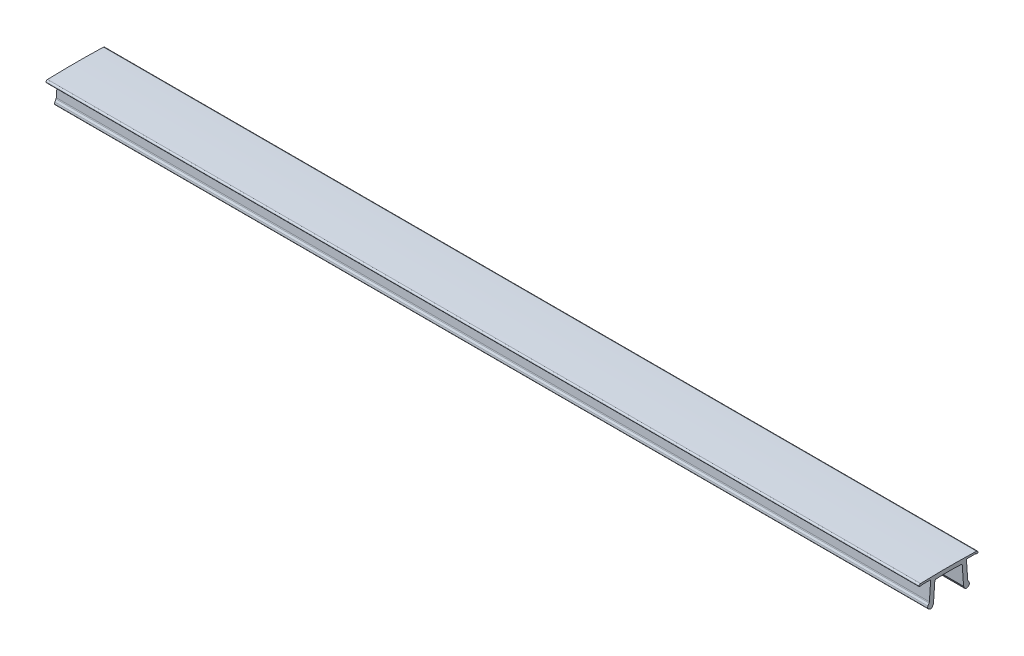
ISO-10303-21;
HEADER;
FILE_DESCRIPTION(('STEP AP214'),'2;1');
FILE_NAME('part.step','',(''),(''),'','','');
FILE_SCHEMA(('AUTOMOTIVE_DESIGN { 1 0 10303 214 1 1 1 1 }'));
ENDSEC;
DATA;
#1=APPLICATION_CONTEXT('core data for automotive mechanical design processes');
#2=APPLICATION_PROTOCOL_DEFINITION('international standard','automotive_design',2000,#1);
#3=PRODUCT_CONTEXT('',#1,'mechanical');
#4=PRODUCT('Part','Part','',(#3));
#5=PRODUCT_RELATED_PRODUCT_CATEGORY('part','',(#4));
#6=PRODUCT_DEFINITION_FORMATION('','',#4);
#7=PRODUCT_DEFINITION_CONTEXT('part definition',#1,'design');
#8=PRODUCT_DEFINITION('design','',#6,#7);
#9=PRODUCT_DEFINITION_SHAPE('','',#8);
#10=(LENGTH_UNIT() NAMED_UNIT(*) SI_UNIT(.MILLI.,.METRE.));
#11=(NAMED_UNIT(*) PLANE_ANGLE_UNIT() SI_UNIT($,.RADIAN.));
#12=(NAMED_UNIT(*) SI_UNIT($,.STERADIAN.) SOLID_ANGLE_UNIT());
#13=UNCERTAINTY_MEASURE_WITH_UNIT(LENGTH_MEASURE(1.E-05),#10,'distance_accuracy_value','');
#14=(GEOMETRIC_REPRESENTATION_CONTEXT(3) GLOBAL_UNCERTAINTY_ASSIGNED_CONTEXT((#13)) GLOBAL_UNIT_ASSIGNED_CONTEXT((#10,
#11,#12)) REPRESENTATION_CONTEXT('',''));
#15=CARTESIAN_POINT('',(0.,0.,0.));
#16=DIRECTION('',(0.,0.,1.));
#17=DIRECTION('',(1.,0.,0.));
#18=AXIS2_PLACEMENT_3D('',#15,#16,#17);
#19=CARTESIAN_POINT('',(200.,-196.779245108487,-0.393315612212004));
#20=DIRECTION('',(-1.,0.,0.));
#21=DIRECTION('',(0.,0.,1.));
#22=AXIS2_PLACEMENT_3D('',#19,#20,#21);
#23=CYLINDRICAL_SURFACE('',#22,199.999990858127);
#24=CARTESIAN_POINT('',(0.,-196.779245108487,-0.393315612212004));
#25=DIRECTION('',(1.,0.,0.));
#26=DIRECTION('',(0.,0.,-1.));
#27=AXIS2_PLACEMENT_3D('',#24,#25,#26);
#28=CIRCLE('',#27,199.999990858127);
#29=CARTESIAN_POINT('',(0.,3.1179599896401,-6.80453524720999));
#30=VERTEX_POINT('',#29);
#31=CARTESIAN_POINT('',(0.,3.11795998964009,6.01790402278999));
#32=VERTEX_POINT('',#31);
#33=EDGE_CURVE('E446',#30,#32,#28,.T.);
#34=ORIENTED_EDGE('',*,*,#33,.T.);
#35=DIRECTION('',(-1.,0.,0.));
#36=VECTOR('',#35,1.);
#37=CARTESIAN_POINT('',(200.,3.11795998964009,6.01790402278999));
#38=LINE('',#37,#36);
#39=CARTESIAN_POINT('',(200.,3.11795998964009,6.01790402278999));
#40=VERTEX_POINT('',#39);
#41=EDGE_CURVE('E12',#40,#32,#38,.T.);
#42=ORIENTED_EDGE('',*,*,#41,.F.);
#43=CARTESIAN_POINT('',(200.,-196.779245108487,-0.393315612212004));
#44=DIRECTION('',(1.,0.,0.));
#45=DIRECTION('',(0.,0.,-1.));
#46=AXIS2_PLACEMENT_3D('',#43,#44,#45);
#47=CIRCLE('',#46,199.999990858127);
#48=CARTESIAN_POINT('',(200.,3.1179599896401,-6.80453524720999));
#49=VERTEX_POINT('',#48);
#50=EDGE_CURVE('E558',#49,#40,#47,.T.);
#51=ORIENTED_EDGE('',*,*,#50,.F.);
#52=DIRECTION('',(-1.,0.,0.));
#53=VECTOR('',#52,1.);
#54=CARTESIAN_POINT('',(200.,3.1179599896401,-6.80453524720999));
#55=LINE('',#54,#53);
#56=EDGE_CURVE('E442',#49,#30,#55,.T.);
#57=ORIENTED_EDGE('',*,*,#56,.T.);
#58=EDGE_LOOP('',(#34,#42,#51,#57));
#59=FACE_BOUND('',#58,.T.);
#60=ADVANCED_FACE('F165',(#59),#23,.T.);
#61=CARTESIAN_POINT('',(200.,2.76813986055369,6.00668438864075));
#62=DIRECTION('',(-1.,0.,0.));
#63=DIRECTION('',(0.,0.,1.));
#64=AXIS2_PLACEMENT_3D('',#61,#62,#63);
#65=CYLINDRICAL_SURFACE('',#64,0.350000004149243);
#66=CARTESIAN_POINT('',(0.,2.76813986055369,6.00668438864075));
#67=DIRECTION('',(1.,0.,0.));
#68=DIRECTION('',(0.,0.,-1.));
#69=AXIS2_PLACEMENT_3D('',#66,#67,#68);
#70=CIRCLE('',#69,0.350000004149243);
#71=CARTESIAN_POINT('',(0.,2.76813986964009,6.35668439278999));
#72=VERTEX_POINT('',#71);
#73=EDGE_CURVE('E450',#32,#72,#70,.T.);
#74=ORIENTED_EDGE('',*,*,#73,.T.);
#75=DIRECTION('',(-1.,0.,0.));
#76=VECTOR('',#75,1.);
#77=CARTESIAN_POINT('',(200.,2.76813986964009,6.35668439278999));
#78=LINE('',#77,#76);
#79=CARTESIAN_POINT('',(200.,2.76813986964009,6.35668439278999));
#80=VERTEX_POINT('',#79);
#81=EDGE_CURVE('E174',#80,#72,#78,.T.);
#82=ORIENTED_EDGE('',*,*,#81,.F.);
#83=CARTESIAN_POINT('',(200.,2.76813986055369,6.00668438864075));
#84=DIRECTION('',(1.,0.,0.));
#85=DIRECTION('',(0.,0.,-1.));
#86=AXIS2_PLACEMENT_3D('',#83,#84,#85);
#87=CIRCLE('',#86,0.350000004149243);
#88=EDGE_CURVE('E315',#40,#80,#87,.T.);
#89=ORIENTED_EDGE('',*,*,#88,.F.);
#90=ORIENTED_EDGE('',*,*,#41,.T.);
#91=EDGE_LOOP('',(#74,#82,#89,#90));
#92=FACE_BOUND('',#91,.T.);
#93=ADVANCED_FACE('F834',(#92),#65,.T.);
#94=CARTESIAN_POINT('',(200.,2.76813986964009,6.35668439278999));
#95=DIRECTION('',(0.,0.,-1.));
#96=DIRECTION('',(-1.,0.,0.));
#97=AXIS2_PLACEMENT_3D('',#94,#95,#96);
#98=PLANE('',#97);
#99=DIRECTION('',(0.,-1.,0.));
#100=VECTOR('',#99,1.);
#101=CARTESIAN_POINT('',(0.,2.76813986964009,6.35668439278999));
#102=LINE('',#101,#100);
#103=CARTESIAN_POINT('',(0.,2.72074574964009,6.35668439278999));
#104=VERTEX_POINT('',#103);
#105=EDGE_CURVE('E453',#72,#104,#102,.T.);
#106=ORIENTED_EDGE('',*,*,#105,.T.);
#107=DIRECTION('',(-1.,0.,0.));
#108=VECTOR('',#107,1.);
#109=CARTESIAN_POINT('',(200.,2.72074574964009,6.35668439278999));
#110=LINE('',#109,#108);
#111=CARTESIAN_POINT('',(200.,2.72074574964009,6.35668439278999));
#112=VERTEX_POINT('',#111);
#113=EDGE_CURVE('E689',#112,#104,#110,.T.);
#114=ORIENTED_EDGE('',*,*,#113,.F.);
#115=DIRECTION('',(0.,-1.,0.));
#116=VECTOR('',#115,1.);
#117=CARTESIAN_POINT('',(200.,2.76813986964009,6.35668439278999));
#118=LINE('',#117,#116);
#119=EDGE_CURVE('E699',#80,#112,#118,.T.);
#120=ORIENTED_EDGE('',*,*,#119,.F.);
#121=ORIENTED_EDGE('',*,*,#81,.T.);
#122=EDGE_LOOP('',(#106,#114,#120,#121));
#123=FACE_BOUND('',#122,.T.);
#124=ADVANCED_FACE('F697',(#123),#98,.F.);
#125=CARTESIAN_POINT('',(200.,2.72074574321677,6.2566843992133));
#126=DIRECTION('',(-1.,0.,0.));
#127=DIRECTION('',(0.,0.,1.));
#128=AXIS2_PLACEMENT_3D('',#125,#126,#127);
#129=CYLINDRICAL_SURFACE('',#128,0.0999999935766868);
#130=CARTESIAN_POINT('',(0.,2.72074574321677,6.2566843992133));
#131=DIRECTION('',(1.,0.,0.));
#132=DIRECTION('',(0.,0.,-1.));
#133=AXIS2_PLACEMENT_3D('',#130,#131,#132);
#134=CIRCLE('',#133,0.0999999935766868);
#135=CARTESIAN_POINT('',(0.,2.62074574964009,6.25668439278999));
#136=VERTEX_POINT('',#135);
#137=EDGE_CURVE('E456',#104,#136,#134,.T.);
#138=ORIENTED_EDGE('',*,*,#137,.T.);
#139=DIRECTION('',(-1.,0.,0.));
#140=VECTOR('',#139,1.);
#141=CARTESIAN_POINT('',(200.,2.62074574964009,6.25668439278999));
#142=LINE('',#141,#140);
#143=CARTESIAN_POINT('',(200.,2.62074574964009,6.25668439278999));
#144=VERTEX_POINT('',#143);
#145=EDGE_CURVE('E685',#144,#136,#142,.T.);
#146=ORIENTED_EDGE('',*,*,#145,.F.);
#147=CARTESIAN_POINT('',(200.,2.72074574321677,6.2566843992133));
#148=DIRECTION('',(1.,0.,0.));
#149=DIRECTION('',(0.,0.,-1.));
#150=AXIS2_PLACEMENT_3D('',#147,#148,#149);
#151=CIRCLE('',#150,0.0999999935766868);
#152=EDGE_CURVE('E718',#112,#144,#151,.T.);
#153=ORIENTED_EDGE('',*,*,#152,.F.);
#154=ORIENTED_EDGE('',*,*,#113,.T.);
#155=EDGE_LOOP('',(#138,#146,#153,#154));
#156=FACE_BOUND('',#155,.T.);
#157=ADVANCED_FACE('F708',(#156),#129,.T.);
#158=CARTESIAN_POINT('',(200.,2.62074574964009,6.25668439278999));
#159=DIRECTION('',(0.,1.,0.));
#160=DIRECTION('',(0.,0.,1.));
#161=AXIS2_PLACEMENT_3D('',#158,#159,#160);
#162=PLANE('',#161);
#163=DIRECTION('',(0.,0.,-1.));
#164=VECTOR('',#163,1.);
#165=CARTESIAN_POINT('',(0.,2.62074574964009,6.25668439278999));
#166=LINE('',#165,#164);
#167=CARTESIAN_POINT('',(0.,2.62074574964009,5.95668439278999));
#168=VERTEX_POINT('',#167);
#169=EDGE_CURVE('E459',#136,#168,#166,.T.);
#170=ORIENTED_EDGE('',*,*,#169,.T.);
#171=DIRECTION('',(-1.,0.,0.));
#172=VECTOR('',#171,1.);
#173=CARTESIAN_POINT('',(200.,2.62074574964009,5.95668439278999));
#174=LINE('',#173,#172);
#175=CARTESIAN_POINT('',(200.,2.62074574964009,5.95668439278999));
#176=VERTEX_POINT('',#175);
#177=EDGE_CURVE('E681',#176,#168,#174,.T.);
#178=ORIENTED_EDGE('',*,*,#177,.F.);
#179=DIRECTION('',(0.,0.,-1.));
#180=VECTOR('',#179,1.);
#181=CARTESIAN_POINT('',(200.,2.62074574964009,6.25668439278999));
#182=LINE('',#181,#180);
#183=EDGE_CURVE('E714',#144,#176,#182,.T.);
#184=ORIENTED_EDGE('',*,*,#183,.F.);
#185=ORIENTED_EDGE('',*,*,#145,.T.);
#186=EDGE_LOOP('',(#170,#178,#184,#185));
#187=FACE_BOUND('',#186,.T.);
#188=ADVANCED_FACE('F712',(#187),#162,.F.);
#189=CARTESIAN_POINT('',(200.,2.7207457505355,5.9566843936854));
#190=DIRECTION('',(-1.,0.,0.));
#191=DIRECTION('',(0.,0.,1.));
#192=AXIS2_PLACEMENT_3D('',#189,#190,#191);
#193=CYLINDRICAL_SURFACE('',#192,0.100000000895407);
#194=CARTESIAN_POINT('',(0.,2.7207457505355,5.9566843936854));
#195=DIRECTION('',(1.,0.,0.));
#196=DIRECTION('',(0.,0.,-1.));
#197=AXIS2_PLACEMENT_3D('',#194,#195,#196);
#198=CIRCLE('',#197,0.100000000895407);
#199=CARTESIAN_POINT('',(0.,2.67074574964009,5.87008185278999));
#200=VERTEX_POINT('',#199);
#201=EDGE_CURVE('E462',#168,#200,#198,.T.);
#202=ORIENTED_EDGE('',*,*,#201,.T.);
#203=DIRECTION('',(-1.,0.,0.));
#204=VECTOR('',#203,1.);
#205=CARTESIAN_POINT('',(200.,2.67074574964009,5.87008185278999));
#206=LINE('',#205,#204);
#207=CARTESIAN_POINT('',(200.,2.67074574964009,5.87008185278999));
#208=VERTEX_POINT('',#207);
#209=EDGE_CURVE('E677',#208,#200,#206,.T.);
#210=ORIENTED_EDGE('',*,*,#209,.F.);
#211=CARTESIAN_POINT('',(200.,2.7207457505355,5.9566843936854));
#212=DIRECTION('',(1.,0.,0.));
#213=DIRECTION('',(0.,0.,-1.));
#214=AXIS2_PLACEMENT_3D('',#211,#212,#213);
#215=CIRCLE('',#214,0.100000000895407);
#216=EDGE_CURVE('E717',#176,#208,#215,.T.);
#217=ORIENTED_EDGE('',*,*,#216,.F.);
#218=ORIENTED_EDGE('',*,*,#177,.T.);
#219=EDGE_LOOP('',(#202,#210,#217,#218));
#220=FACE_BOUND('',#219,.T.);
#221=ADVANCED_FACE('F847',(#220),#193,.T.);
#222=CARTESIAN_POINT('',(200.,2.62074574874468,5.78347931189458));
#223=DIRECTION('',(-1.,0.,0.));
#224=DIRECTION('',(0.,0.,1.));
#225=AXIS2_PLACEMENT_3D('',#222,#223,#224);
#226=CYLINDRICAL_SURFACE('',#225,0.100000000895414);
#227=CARTESIAN_POINT('',(0.,2.62074574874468,5.78347931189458));
#228=DIRECTION('',(-1.,0.,0.));
#229=DIRECTION('',(0.,0.,-1.));
#230=AXIS2_PLACEMENT_3D('',#227,#228,#229);
#231=CIRCLE('',#230,0.100000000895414);
#232=CARTESIAN_POINT('',(0.,2.72074574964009,5.78347931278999));
#233=VERTEX_POINT('',#232);
#234=EDGE_CURVE('E465',#200,#233,#231,.T.);
#235=ORIENTED_EDGE('',*,*,#234,.T.);
#236=DIRECTION('',(-1.,0.,0.));
#237=VECTOR('',#236,1.);
#238=CARTESIAN_POINT('',(200.,2.72074574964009,5.78347931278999));
#239=LINE('',#238,#237);
#240=CARTESIAN_POINT('',(200.,2.72074574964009,5.78347931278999));
#241=VERTEX_POINT('',#240);
#242=EDGE_CURVE('E673',#241,#233,#239,.T.);
#243=ORIENTED_EDGE('',*,*,#242,.F.);
#244=CARTESIAN_POINT('',(200.,2.62074574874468,5.78347931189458));
#245=DIRECTION('',(-1.,0.,0.));
#246=DIRECTION('',(0.,0.,-1.));
#247=AXIS2_PLACEMENT_3D('',#244,#245,#246);
#248=CIRCLE('',#247,0.100000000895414);
#249=EDGE_CURVE('E722',#208,#241,#248,.T.);
#250=ORIENTED_EDGE('',*,*,#249,.F.);
#251=ORIENTED_EDGE('',*,*,#209,.T.);
#252=EDGE_LOOP('',(#235,#243,#250,#251));
#253=FACE_BOUND('',#252,.T.);
#254=ADVANCED_FACE('F850',(#253),#226,.F.);
#255=CARTESIAN_POINT('',(200.,2.72074574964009,5.78347931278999));
#256=DIRECTION('',(0.,1.,0.));
#257=DIRECTION('',(0.,0.,1.));
#258=AXIS2_PLACEMENT_3D('',#255,#256,#257);
#259=PLANE('',#258);
#260=DIRECTION('',(0.,0.,-1.));
#261=VECTOR('',#260,1.);
#262=CARTESIAN_POINT('',(0.,2.72074574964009,5.78347931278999));
#263=LINE('',#262,#261);
#264=CARTESIAN_POINT('',(0.,2.72074574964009,3.80692858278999));
#265=VERTEX_POINT('',#264);
#266=EDGE_CURVE('E468',#233,#265,#263,.T.);
#267=ORIENTED_EDGE('',*,*,#266,.T.);
#268=DIRECTION('',(-1.,0.,0.));
#269=VECTOR('',#268,1.);
#270=CARTESIAN_POINT('',(200.,2.72074574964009,3.80692858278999));
#271=LINE('',#270,#269);
#272=CARTESIAN_POINT('',(200.,2.72074574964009,3.80692858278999));
#273=VERTEX_POINT('',#272);
#274=EDGE_CURVE('E669',#273,#265,#271,.T.);
#275=ORIENTED_EDGE('',*,*,#274,.F.);
#276=DIRECTION('',(0.,0.,-1.));
#277=VECTOR('',#276,1.);
#278=CARTESIAN_POINT('',(200.,2.72074574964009,5.78347931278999));
#279=LINE('',#278,#277);
#280=EDGE_CURVE('E729',#241,#273,#279,.T.);
#281=ORIENTED_EDGE('',*,*,#280,.F.);
#282=ORIENTED_EDGE('',*,*,#242,.T.);
#283=EDGE_LOOP('',(#267,#275,#281,#282));
#284=FACE_BOUND('',#283,.T.);
#285=ADVANCED_FACE('F854',(#284),#259,.F.);
#286=CARTESIAN_POINT('',(200.,2.62074574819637,3.80692857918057));
#287=DIRECTION('',(-1.,0.,0.));
#288=DIRECTION('',(0.,0.,1.));
#289=AXIS2_PLACEMENT_3D('',#286,#287,#288);
#290=CYLINDRICAL_SURFACE('',#289,0.100000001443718);
#291=CARTESIAN_POINT('',(0.,2.62074574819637,3.80692857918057));
#292=DIRECTION('',(-1.,0.,0.));
#293=DIRECTION('',(0.,0.,-1.));
#294=AXIS2_PLACEMENT_3D('',#291,#292,#293);
#295=CIRCLE('',#294,0.100000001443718);
#296=CARTESIAN_POINT('',(0.,2.61377009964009,3.70717217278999));
#297=VERTEX_POINT('',#296);
#298=EDGE_CURVE('E471',#265,#297,#295,.T.);
#299=ORIENTED_EDGE('',*,*,#298,.T.);
#300=DIRECTION('',(-1.,0.,0.));
#301=VECTOR('',#300,1.);
#302=CARTESIAN_POINT('',(200.,2.61377009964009,3.70717217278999));
#303=LINE('',#302,#301);
#304=CARTESIAN_POINT('',(200.,2.61377009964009,3.70717217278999));
#305=VERTEX_POINT('',#304);
#306=EDGE_CURVE('E665',#305,#297,#303,.T.);
#307=ORIENTED_EDGE('',*,*,#306,.F.);
#308=CARTESIAN_POINT('',(200.,2.62074574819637,3.80692857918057));
#309=DIRECTION('',(-1.,0.,0.));
#310=DIRECTION('',(0.,0.,-1.));
#311=AXIS2_PLACEMENT_3D('',#308,#309,#310);
#312=CIRCLE('',#311,0.100000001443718);
#313=EDGE_CURVE('E732',#273,#305,#312,.T.);
#314=ORIENTED_EDGE('',*,*,#313,.F.);
#315=ORIENTED_EDGE('',*,*,#274,.T.);
#316=EDGE_LOOP('',(#299,#307,#314,#315));
#317=FACE_BOUND('',#316,.T.);
#318=ADVANCED_FACE('F858',(#317),#290,.F.);
#319=CARTESIAN_POINT('',(200.,2.61377009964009,3.70717217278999));
#320=DIRECTION('',(0.,-0.0697564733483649,-0.997564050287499));
#321=DIRECTION('',(0.,0.997564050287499,-0.0697564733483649));
#322=AXIS2_PLACEMENT_3D('',#319,#320,#321);
#323=PLANE('',#322);
#324=DIRECTION('',(0.,-0.997564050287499,0.0697564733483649));
#325=VECTOR('',#324,1.);
#326=CARTESIAN_POINT('',(0.,2.61377009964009,3.70717217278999));
#327=LINE('',#326,#325);
#328=CARTESIAN_POINT('',(0.,-1.51994333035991,3.99622957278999));
#329=VERTEX_POINT('',#328);
#330=EDGE_CURVE('E474',#297,#329,#327,.T.);
#331=ORIENTED_EDGE('',*,*,#330,.T.);
#332=DIRECTION('',(-1.,0.,0.));
#333=VECTOR('',#332,1.);
#334=CARTESIAN_POINT('',(200.,-1.51994333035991,3.99622957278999));
#335=LINE('',#334,#333);
#336=CARTESIAN_POINT('',(200.,-1.51994333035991,3.99622957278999));
#337=VERTEX_POINT('',#336);
#338=EDGE_CURVE('E661',#337,#329,#335,.T.);
#339=ORIENTED_EDGE('',*,*,#338,.F.);
#340=DIRECTION('',(0.,-0.997564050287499,0.0697564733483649));
#341=VECTOR('',#340,1.);
#342=CARTESIAN_POINT('',(200.,2.61377009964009,3.70717217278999));
#343=LINE('',#342,#341);
#344=EDGE_CURVE('E735',#305,#337,#343,.T.);
#345=ORIENTED_EDGE('',*,*,#344,.F.);
#346=ORIENTED_EDGE('',*,*,#306,.T.);
#347=EDGE_LOOP('',(#331,#339,#345,#346));
#348=FACE_BOUND('',#347,.T.);
#349=ADVANCED_FACE('F862',(#348),#323,.F.);
#350=CARTESIAN_POINT('',(200.,-1.48506514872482,4.49501142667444));
#351=DIRECTION('',(-1.,0.,0.));
#352=DIRECTION('',(0.,0.,1.));
#353=AXIS2_PLACEMENT_3D('',#350,#351,#352);
#354=CYLINDRICAL_SURFACE('',#353,0.49999982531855);
#355=CARTESIAN_POINT('',(0.,-1.48506514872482,4.49501142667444));
#356=DIRECTION('',(-1.,0.,0.));
#357=DIRECTION('',(0.,0.,-1.));
#358=AXIS2_PLACEMENT_3D('',#355,#356,#357);
#359=CIRCLE('',#358,0.49999982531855);
#360=CARTESIAN_POINT('',(0.,-1.73506509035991,4.06199889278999));
#361=VERTEX_POINT('',#360);
#362=EDGE_CURVE('E477',#329,#361,#359,.T.);
#363=ORIENTED_EDGE('',*,*,#362,.T.);
#364=DIRECTION('',(-1.,0.,0.));
#365=VECTOR('',#364,1.);
#366=CARTESIAN_POINT('',(200.,-1.73506509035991,4.06199889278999));
#367=LINE('',#366,#365);
#368=CARTESIAN_POINT('',(200.,-1.73506509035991,4.06199889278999));
#369=VERTEX_POINT('',#368);
#370=EDGE_CURVE('E657',#369,#361,#367,.T.);
#371=ORIENTED_EDGE('',*,*,#370,.F.);
#372=CARTESIAN_POINT('',(200.,-1.48506514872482,4.49501142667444));
#373=DIRECTION('',(-1.,0.,0.));
#374=DIRECTION('',(0.,0.,-1.));
#375=AXIS2_PLACEMENT_3D('',#372,#373,#374);
#376=CIRCLE('',#375,0.49999982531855);
#377=EDGE_CURVE('E738',#337,#369,#376,.T.);
#378=ORIENTED_EDGE('',*,*,#377,.F.);
#379=ORIENTED_EDGE('',*,*,#338,.T.);
#380=EDGE_LOOP('',(#363,#371,#378,#379));
#381=FACE_BOUND('',#380,.T.);
#382=ADVANCED_FACE('F866',(#381),#354,.F.);
#383=CARTESIAN_POINT('',(200.,-1.73506509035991,4.06199889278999));
#384=DIRECTION('',(0.,-0.499999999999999,-0.866025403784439));
#385=DIRECTION('',(0.,0.866025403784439,-0.499999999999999));
#386=AXIS2_PLACEMENT_3D('',#383,#384,#385);
#387=PLANE('',#386);
#388=DIRECTION('',(0.,-0.866025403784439,0.499999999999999));
#389=VECTOR('',#388,1.);
#390=CARTESIAN_POINT('',(0.,-1.73506509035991,4.06199889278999));
#391=LINE('',#390,#389);
#392=CARTESIAN_POINT('',(0.,-2.19608081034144,4.32816644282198));
#393=VERTEX_POINT('',#392);
#394=EDGE_CURVE('E480',#361,#393,#391,.T.);
#395=ORIENTED_EDGE('',*,*,#394,.T.);
#396=DIRECTION('',(-1.,0.,0.));
#397=VECTOR('',#396,1.);
#398=CARTESIAN_POINT('',(200.,-2.19608081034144,4.32816644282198));
#399=LINE('',#398,#397);
#400=CARTESIAN_POINT('',(200.,-2.19608081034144,4.32816644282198));
#401=VERTEX_POINT('',#400);
#402=EDGE_CURVE('E653',#401,#393,#399,.T.);
#403=ORIENTED_EDGE('',*,*,#402,.F.);
#404=DIRECTION('',(0.,-0.866025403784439,0.499999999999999));
#405=VECTOR('',#404,1.);
#406=CARTESIAN_POINT('',(200.,-1.73506509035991,4.06199889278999));
#407=LINE('',#406,#405);
#408=EDGE_CURVE('E741',#369,#401,#407,.T.);
#409=ORIENTED_EDGE('',*,*,#408,.F.);
#410=ORIENTED_EDGE('',*,*,#370,.T.);
#411=EDGE_LOOP('',(#395,#403,#409,#410));
#412=FACE_BOUND('',#411,.T.);
#413=ADVANCED_FACE('F870',(#412),#387,.F.);
#414=CARTESIAN_POINT('',(200.,-2.44608080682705,3.89515373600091));
#415=DIRECTION('',(-1.,0.,0.));
#416=DIRECTION('',(0.,0.,1.));
#417=AXIS2_PLACEMENT_3D('',#414,#415,#416);
#418=CYLINDRICAL_SURFACE('',#417,0.500000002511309);
#419=CARTESIAN_POINT('',(0.,-2.44608080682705,3.89515373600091));
#420=DIRECTION('',(1.,0.,0.));
#421=DIRECTION('',(0.,0.,-1.));
#422=AXIS2_PLACEMENT_3D('',#419,#420,#421);
#423=CIRCLE('',#422,0.500000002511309);
#424=CARTESIAN_POINT('',(0.,-2.89923470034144,4.10646287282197));
#425=VERTEX_POINT('',#424);
#426=EDGE_CURVE('E483',#393,#425,#423,.T.);
#427=ORIENTED_EDGE('',*,*,#426,.T.);
#428=DIRECTION('',(-1.,0.,0.));
#429=VECTOR('',#428,1.);
#430=CARTESIAN_POINT('',(200.,-2.89923470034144,4.10646287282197));
#431=LINE('',#430,#429);
#432=CARTESIAN_POINT('',(200.,-2.89923470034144,4.10646287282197));
#433=VERTEX_POINT('',#432);
#434=EDGE_CURVE('E649',#433,#425,#431,.T.);
#435=ORIENTED_EDGE('',*,*,#434,.F.);
#436=CARTESIAN_POINT('',(200.,-2.44608080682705,3.89515373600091));
#437=DIRECTION('',(1.,0.,0.));
#438=DIRECTION('',(0.,0.,-1.));
#439=AXIS2_PLACEMENT_3D('',#436,#437,#438);
#440=CIRCLE('',#439,0.500000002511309);
#441=EDGE_CURVE('E744',#401,#433,#440,.T.);
#442=ORIENTED_EDGE('',*,*,#441,.F.);
#443=ORIENTED_EDGE('',*,*,#402,.T.);
#444=EDGE_LOOP('',(#427,#435,#442,#443));
#445=FACE_BOUND('',#444,.T.);
#446=ADVANCED_FACE('F874',(#445),#418,.T.);
#447=CARTESIAN_POINT('',(200.,-2.89923470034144,4.10646287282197));
#448=DIRECTION('',(0.,0.906307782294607,-0.422618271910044));
#449=DIRECTION('',(0.,0.422618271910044,0.906307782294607));
#450=AXIS2_PLACEMENT_3D('',#447,#448,#449);
#451=PLANE('',#450);
#452=DIRECTION('',(0.,-0.422618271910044,-0.906307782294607));
#453=VECTOR('',#452,1.);
#454=CARTESIAN_POINT('',(0.,-2.89923470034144,4.10646287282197));
#455=LINE('',#454,#453);
#456=CARTESIAN_POINT('',(0.,-3.06153288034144,3.75841331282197));
#457=VERTEX_POINT('',#456);
#458=EDGE_CURVE('E486',#425,#457,#455,.T.);
#459=ORIENTED_EDGE('',*,*,#458,.T.);
#460=DIRECTION('',(-1.,0.,0.));
#461=VECTOR('',#460,1.);
#462=CARTESIAN_POINT('',(200.,-3.06153288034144,3.75841331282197));
#463=LINE('',#462,#461);
#464=CARTESIAN_POINT('',(200.,-3.06153288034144,3.75841331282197));
#465=VERTEX_POINT('',#464);
#466=EDGE_CURVE('E645',#465,#457,#463,.T.);
#467=ORIENTED_EDGE('',*,*,#466,.F.);
#468=DIRECTION('',(0.,-0.422618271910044,-0.906307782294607));
#469=VECTOR('',#468,1.);
#470=CARTESIAN_POINT('',(200.,-2.89923470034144,4.10646287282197));
#471=LINE('',#470,#469);
#472=EDGE_CURVE('E747',#433,#465,#471,.T.);
#473=ORIENTED_EDGE('',*,*,#472,.F.);
#474=ORIENTED_EDGE('',*,*,#434,.T.);
#475=EDGE_LOOP('',(#459,#467,#473,#474));
#476=FACE_BOUND('',#475,.T.);
#477=ADVANCED_FACE('F878',(#476),#451,.F.);
#478=CARTESIAN_POINT('',(200.,-2.78964055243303,3.6316278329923));
#479=DIRECTION('',(-1.,0.,0.));
#480=DIRECTION('',(0.,0.,1.));
#481=AXIS2_PLACEMENT_3D('',#478,#479,#480);
#482=CYLINDRICAL_SURFACE('',#481,0.29999999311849);
#483=CARTESIAN_POINT('',(0.,-2.78964055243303,3.6316278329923));
#484=DIRECTION('',(1.,0.,0.));
#485=DIRECTION('',(0.,0.,-1.));
#486=AXIS2_PLACEMENT_3D('',#483,#484,#485);
#487=CIRCLE('',#486,0.29999999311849);
#488=CARTESIAN_POINT('',(0.,-2.93964054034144,3.37182021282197));
#489=VERTEX_POINT('',#488);
#490=EDGE_CURVE('E489',#457,#489,#487,.T.);
#491=ORIENTED_EDGE('',*,*,#490,.T.);
#492=DIRECTION('',(-1.,0.,0.));
#493=VECTOR('',#492,1.);
#494=CARTESIAN_POINT('',(200.,-2.93964054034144,3.37182021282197));
#495=LINE('',#494,#493);
#496=CARTESIAN_POINT('',(200.,-2.93964054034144,3.37182021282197));
#497=VERTEX_POINT('',#496);
#498=EDGE_CURVE('E641',#497,#489,#495,.T.);
#499=ORIENTED_EDGE('',*,*,#498,.F.);
#500=CARTESIAN_POINT('',(200.,-2.78964055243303,3.6316278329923));
#501=DIRECTION('',(1.,0.,0.));
#502=DIRECTION('',(0.,0.,-1.));
#503=AXIS2_PLACEMENT_3D('',#500,#501,#502);
#504=CIRCLE('',#503,0.29999999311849);
#505=EDGE_CURVE('E750',#465,#497,#504,.T.);
#506=ORIENTED_EDGE('',*,*,#505,.F.);
#507=ORIENTED_EDGE('',*,*,#466,.T.);
#508=EDGE_LOOP('',(#491,#499,#506,#507));
#509=FACE_BOUND('',#508,.T.);
#510=ADVANCED_FACE('F882',(#509),#482,.T.);
#511=CARTESIAN_POINT('',(200.,-2.93964054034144,3.37182021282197));
#512=DIRECTION('',(0.,0.500000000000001,0.866025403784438));
#513=DIRECTION('',(0.,-0.866025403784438,0.500000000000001));
#514=AXIS2_PLACEMENT_3D('',#511,#512,#513);
#515=PLANE('',#514);
#516=DIRECTION('',(0.,0.866025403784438,-0.500000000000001));
#517=VECTOR('',#516,1.);
#518=CARTESIAN_POINT('',(0.,-2.93964054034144,3.37182021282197));
#519=LINE('',#518,#517);
#520=CARTESIAN_POINT('',(0.,-2.45026286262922,3.08927787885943));
#521=VERTEX_POINT('',#520);
#522=EDGE_CURVE('E492',#489,#521,#519,.T.);
#523=ORIENTED_EDGE('',*,*,#522,.T.);
#524=DIRECTION('',(-1.,0.,0.));
#525=VECTOR('',#524,1.);
#526=CARTESIAN_POINT('',(200.,-2.45026286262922,3.08927787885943));
#527=LINE('',#526,#525);
#528=CARTESIAN_POINT('',(200.,-2.45026286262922,3.08927787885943));
#529=VERTEX_POINT('',#528);
#530=EDGE_CURVE('E637',#529,#521,#527,.T.);
#531=ORIENTED_EDGE('',*,*,#530,.F.);
#532=DIRECTION('',(0.,0.866025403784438,-0.500000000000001));
#533=VECTOR('',#532,1.);
#534=CARTESIAN_POINT('',(200.,-2.93964054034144,3.37182021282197));
#535=LINE('',#534,#533);
#536=EDGE_CURVE('E753',#497,#529,#535,.T.);
#537=ORIENTED_EDGE('',*,*,#536,.F.);
#538=ORIENTED_EDGE('',*,*,#498,.T.);
#539=EDGE_LOOP('',(#523,#531,#537,#538));
#540=FACE_BOUND('',#539,.T.);
#541=ADVANCED_FACE('F886',(#540),#515,.F.);
#542=CARTESIAN_POINT('',(200.,-2.30026282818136,3.34908564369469));
#543=DIRECTION('',(-1.,0.,0.));
#544=DIRECTION('',(0.,0.,1.));
#545=AXIS2_PLACEMENT_3D('',#542,#543,#544);
#546=CYLINDRICAL_SURFACE('',#545,0.300000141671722);
#547=CARTESIAN_POINT('',(0.,-2.30026282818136,3.34908564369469));
#548=DIRECTION('',(1.,0.,0.));
#549=DIRECTION('',(0.,0.,-1.));
#550=AXIS2_PLACEMENT_3D('',#547,#548,#549);
#551=CIRCLE('',#550,0.300000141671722);
#552=CARTESIAN_POINT('',(0.,-2.32118980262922,3.04981628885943));
#553=VERTEX_POINT('',#552);
#554=EDGE_CURVE('E495',#521,#553,#551,.T.);
#555=ORIENTED_EDGE('',*,*,#554,.T.);
#556=DIRECTION('',(-1.,0.,0.));
#557=VECTOR('',#556,1.);
#558=CARTESIAN_POINT('',(200.,-2.32118980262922,3.04981628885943));
#559=LINE('',#558,#557);
#560=CARTESIAN_POINT('',(200.,-2.32118980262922,3.04981628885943));
#561=VERTEX_POINT('',#560);
#562=EDGE_CURVE('E633',#561,#553,#559,.T.);
#563=ORIENTED_EDGE('',*,*,#562,.F.);
#564=CARTESIAN_POINT('',(200.,-2.30026282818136,3.34908564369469));
#565=DIRECTION('',(1.,0.,0.));
#566=DIRECTION('',(0.,0.,-1.));
#567=AXIS2_PLACEMENT_3D('',#564,#565,#566);
#568=CIRCLE('',#567,0.300000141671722);
#569=EDGE_CURVE('E756',#529,#561,#568,.T.);
#570=ORIENTED_EDGE('',*,*,#569,.F.);
#571=ORIENTED_EDGE('',*,*,#530,.T.);
#572=EDGE_LOOP('',(#555,#563,#570,#571));
#573=FACE_BOUND('',#572,.T.);
#574=ADVANCED_FACE('F890',(#573),#546,.T.);
#575=CARTESIAN_POINT('',(200.,-2.32118980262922,3.04981628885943));
#576=DIRECTION('',(0.,0.0697564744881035,0.9975640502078));
#577=DIRECTION('',(0.,-0.9975640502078,0.0697564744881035));
#578=AXIS2_PLACEMENT_3D('',#575,#576,#577);
#579=PLANE('',#578);
#580=DIRECTION('',(0.,0.9975640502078,-0.0697564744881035));
#581=VECTOR('',#580,1.);
#582=CARTESIAN_POINT('',(0.,-2.32118980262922,3.04981628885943));
#583=LINE('',#582,#581);
#584=CARTESIAN_POINT('',(0.,1.96020696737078,2.75043185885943));
#585=VERTEX_POINT('',#584);
#586=EDGE_CURVE('E498',#553,#585,#583,.T.);
#587=ORIENTED_EDGE('',*,*,#586,.T.);
#588=DIRECTION('',(-1.,0.,0.));
#589=VECTOR('',#588,1.);
#590=CARTESIAN_POINT('',(200.,1.96020696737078,2.75043185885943));
#591=LINE('',#590,#589);
#592=CARTESIAN_POINT('',(200.,1.96020696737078,2.75043185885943));
#593=VERTEX_POINT('',#592);
#594=EDGE_CURVE('E629',#593,#585,#591,.T.);
#595=ORIENTED_EDGE('',*,*,#594,.F.);
#596=DIRECTION('',(0.,0.9975640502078,-0.0697564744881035));
#597=VECTOR('',#596,1.);
#598=CARTESIAN_POINT('',(200.,-2.32118980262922,3.04981628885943));
#599=LINE('',#598,#597);
#600=EDGE_CURVE('E759',#561,#593,#599,.T.);
#601=ORIENTED_EDGE('',*,*,#600,.F.);
#602=ORIENTED_EDGE('',*,*,#562,.T.);
#603=EDGE_LOOP('',(#587,#595,#601,#602));
#604=FACE_BOUND('',#603,.T.);
#605=ADVANCED_FACE('F894',(#604),#579,.F.);
#606=CARTESIAN_POINT('',(200.,1.93928002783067,2.45116264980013));
#607=DIRECTION('',(-1.,0.,0.));
#608=DIRECTION('',(0.,0.,1.));
#609=AXIS2_PLACEMENT_3D('',#606,#607,#608);
#610=CYLINDRICAL_SURFACE('',#609,0.299999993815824);
#611=CARTESIAN_POINT('',(0.,1.93928002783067,2.45116264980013));
#612=DIRECTION('',(-1.,0.,0.));
#613=DIRECTION('',(0.,0.,-1.));
#614=AXIS2_PLACEMENT_3D('',#611,#612,#613);
#615=CIRCLE('',#614,0.299999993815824);
#616=CARTESIAN_POINT('',(0.,2.23878827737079,2.46833252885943));
#617=VERTEX_POINT('',#616);
#618=EDGE_CURVE('E501',#585,#617,#615,.T.);
#619=ORIENTED_EDGE('',*,*,#618,.T.);
#620=DIRECTION('',(-1.,0.,0.));
#621=VECTOR('',#620,1.);
#622=CARTESIAN_POINT('',(200.,2.23878827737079,2.46833252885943));
#623=LINE('',#622,#621);
#624=CARTESIAN_POINT('',(200.,2.23878827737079,2.46833252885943));
#625=VERTEX_POINT('',#624);
#626=EDGE_CURVE('E625',#625,#617,#623,.T.);
#627=ORIENTED_EDGE('',*,*,#626,.F.);
#628=CARTESIAN_POINT('',(200.,1.93928002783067,2.45116264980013));
#629=DIRECTION('',(-1.,0.,0.));
#630=DIRECTION('',(0.,0.,-1.));
#631=AXIS2_PLACEMENT_3D('',#628,#629,#630);
#632=CIRCLE('',#631,0.299999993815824);
#633=EDGE_CURVE('E762',#593,#625,#632,.T.);
#634=ORIENTED_EDGE('',*,*,#633,.F.);
#635=ORIENTED_EDGE('',*,*,#594,.T.);
#636=EDGE_LOOP('',(#619,#627,#634,#635));
#637=FACE_BOUND('',#636,.T.);
#638=ADVANCED_FACE('F898',(#637),#610,.F.);
#639=CARTESIAN_POINT('',(200.,-47.6792550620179,-0.393315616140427));
#640=DIRECTION('',(-1.,0.,0.));
#641=DIRECTION('',(0.,0.,1.));
#642=AXIS2_PLACEMENT_3D('',#639,#640,#641);
#643=CYLINDRICAL_SURFACE('',#642,50.0000008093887);
#644=CARTESIAN_POINT('',(0.,-47.6792550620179,-0.393315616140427));
#645=DIRECTION('',(-1.,0.,0.));
#646=DIRECTION('',(0.,0.,-1.));
#647=AXIS2_PLACEMENT_3D('',#644,#645,#646);
#648=CIRCLE('',#647,50.0000008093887);
#649=CARTESIAN_POINT('',(0.,2.23878827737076,-3.25496376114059));
#650=VERTEX_POINT('',#649);
#651=EDGE_CURVE('E504',#617,#650,#648,.T.);
#652=ORIENTED_EDGE('',*,*,#651,.T.);
#653=DIRECTION('',(-1.,0.,0.));
#654=VECTOR('',#653,1.);
#655=CARTESIAN_POINT('',(200.,2.23878827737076,-3.25496376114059));
#656=LINE('',#655,#654);
#657=CARTESIAN_POINT('',(200.,2.23878827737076,-3.25496376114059));
#658=VERTEX_POINT('',#657);
#659=EDGE_CURVE('E621',#658,#650,#656,.T.);
#660=ORIENTED_EDGE('',*,*,#659,.F.);
#661=CARTESIAN_POINT('',(200.,-47.6792550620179,-0.393315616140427));
#662=DIRECTION('',(-1.,0.,0.));
#663=DIRECTION('',(0.,0.,-1.));
#664=AXIS2_PLACEMENT_3D('',#661,#662,#663);
#665=CIRCLE('',#664,50.0000008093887);
#666=EDGE_CURVE('E765',#625,#658,#665,.T.);
#667=ORIENTED_EDGE('',*,*,#666,.F.);
#668=ORIENTED_EDGE('',*,*,#626,.T.);
#669=EDGE_LOOP('',(#652,#660,#667,#668));
#670=FACE_BOUND('',#669,.T.);
#671=ADVANCED_FACE('F902',(#670),#643,.F.);
#672=CARTESIAN_POINT('',(200.,1.93928002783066,-3.23779388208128));
#673=DIRECTION('',(-1.,0.,0.));
#674=DIRECTION('',(0.,0.,1.));
#675=AXIS2_PLACEMENT_3D('',#672,#673,#674);
#676=CYLINDRICAL_SURFACE('',#675,0.299999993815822);
#677=CARTESIAN_POINT('',(0.,1.93928002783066,-3.23779388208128));
#678=DIRECTION('',(-1.,0.,0.));
#679=DIRECTION('',(0.,0.,-1.));
#680=AXIS2_PLACEMENT_3D('',#677,#678,#679);
#681=CIRCLE('',#680,0.299999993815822);
#682=CARTESIAN_POINT('',(0.,1.96020696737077,-3.53706309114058));
#683=VERTEX_POINT('',#682);
#684=EDGE_CURVE('E507',#650,#683,#681,.T.);
#685=ORIENTED_EDGE('',*,*,#684,.T.);
#686=DIRECTION('',(-1.,0.,0.));
#687=VECTOR('',#686,1.);
#688=CARTESIAN_POINT('',(200.,1.96020696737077,-3.53706309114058));
#689=LINE('',#688,#687);
#690=CARTESIAN_POINT('',(200.,1.96020696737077,-3.53706309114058));
#691=VERTEX_POINT('',#690);
#692=EDGE_CURVE('E617',#691,#683,#689,.T.);
#693=ORIENTED_EDGE('',*,*,#692,.F.);
#694=CARTESIAN_POINT('',(200.,1.93928002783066,-3.23779388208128));
#695=DIRECTION('',(-1.,0.,0.));
#696=DIRECTION('',(0.,0.,-1.));
#697=AXIS2_PLACEMENT_3D('',#694,#695,#696);
#698=CIRCLE('',#697,0.299999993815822);
#699=EDGE_CURVE('E768',#658,#691,#698,.T.);
#700=ORIENTED_EDGE('',*,*,#699,.F.);
#701=ORIENTED_EDGE('',*,*,#659,.T.);
#702=EDGE_LOOP('',(#685,#693,#700,#701));
#703=FACE_BOUND('',#702,.T.);
#704=ADVANCED_FACE('F906',(#703),#676,.F.);
#705=CARTESIAN_POINT('',(200.,1.96020696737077,-3.53706309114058));
#706=DIRECTION('',(0.,0.0697564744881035,-0.9975640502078));
#707=DIRECTION('',(0.,0.9975640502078,0.0697564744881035));
#708=AXIS2_PLACEMENT_3D('',#705,#706,#707);
#709=PLANE('',#708);
#710=DIRECTION('',(0.,-0.9975640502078,-0.0697564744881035));
#711=VECTOR('',#710,1.);
#712=CARTESIAN_POINT('',(0.,1.96020696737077,-3.53706309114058));
#713=LINE('',#712,#711);
#714=CARTESIAN_POINT('',(0.,-2.32118980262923,-3.83644752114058));
#715=VERTEX_POINT('',#714);
#716=EDGE_CURVE('E510',#683,#715,#713,.T.);
#717=ORIENTED_EDGE('',*,*,#716,.T.);
#718=DIRECTION('',(-1.,0.,0.));
#719=VECTOR('',#718,1.);
#720=CARTESIAN_POINT('',(200.,-2.32118980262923,-3.83644752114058));
#721=LINE('',#720,#719);
#722=CARTESIAN_POINT('',(200.,-2.32118980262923,-3.83644752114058));
#723=VERTEX_POINT('',#722);
#724=EDGE_CURVE('E613',#723,#715,#721,.T.);
#725=ORIENTED_EDGE('',*,*,#724,.F.);
#726=DIRECTION('',(0.,-0.9975640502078,-0.0697564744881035));
#727=VECTOR('',#726,1.);
#728=CARTESIAN_POINT('',(200.,1.96020696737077,-3.53706309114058));
#729=LINE('',#728,#727);
#730=EDGE_CURVE('E771',#691,#723,#729,.T.);
#731=ORIENTED_EDGE('',*,*,#730,.F.);
#732=ORIENTED_EDGE('',*,*,#692,.T.);
#733=EDGE_LOOP('',(#717,#725,#731,#732));
#734=FACE_BOUND('',#733,.T.);
#735=ADVANCED_FACE('F910',(#734),#709,.F.);
#736=CARTESIAN_POINT('',(200.,-2.30026293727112,-4.13571651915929));
#737=DIRECTION('',(-1.,0.,0.));
#738=DIRECTION('',(0.,0.,1.));
#739=AXIS2_PLACEMENT_3D('',#736,#737,#738);
#740=CYLINDRICAL_SURFACE('',#739,0.299999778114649);
#741=CARTESIAN_POINT('',(0.,-2.30026293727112,-4.13571651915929));
#742=DIRECTION('',(1.,0.,0.));
#743=DIRECTION('',(0.,0.,-1.));
#744=AXIS2_PLACEMENT_3D('',#741,#742,#743);
#745=CIRCLE('',#744,0.299999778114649);
#746=CARTESIAN_POINT('',(0.,-2.45026286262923,-3.87590911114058));
#747=VERTEX_POINT('',#746);
#748=EDGE_CURVE('E513',#715,#747,#745,.T.);
#749=ORIENTED_EDGE('',*,*,#748,.T.);
#750=DIRECTION('',(-1.,0.,0.));
#751=VECTOR('',#750,1.);
#752=CARTESIAN_POINT('',(200.,-2.45026286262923,-3.87590911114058));
#753=LINE('',#752,#751);
#754=CARTESIAN_POINT('',(200.,-2.45026286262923,-3.87590911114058));
#755=VERTEX_POINT('',#754);
#756=EDGE_CURVE('E609',#755,#747,#753,.T.);
#757=ORIENTED_EDGE('',*,*,#756,.F.);
#758=CARTESIAN_POINT('',(200.,-2.30026293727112,-4.13571651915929));
#759=DIRECTION('',(1.,0.,0.));
#760=DIRECTION('',(0.,0.,-1.));
#761=AXIS2_PLACEMENT_3D('',#758,#759,#760);
#762=CIRCLE('',#761,0.299999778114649);
#763=EDGE_CURVE('E774',#723,#755,#762,.T.);
#764=ORIENTED_EDGE('',*,*,#763,.F.);
#765=ORIENTED_EDGE('',*,*,#724,.T.);
#766=EDGE_LOOP('',(#749,#757,#764,#765));
#767=FACE_BOUND('',#766,.T.);
#768=ADVANCED_FACE('F914',(#767),#740,.T.);
#769=CARTESIAN_POINT('',(200.,-2.45026286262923,-3.87590911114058));
#770=DIRECTION('',(0.,0.5,-0.866025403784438));
#771=DIRECTION('',(0.,0.866025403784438,0.5));
#772=AXIS2_PLACEMENT_3D('',#769,#770,#771);
#773=PLANE('',#772);
#774=DIRECTION('',(0.,-0.866025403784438,-0.5));
#775=VECTOR('',#774,1.);
#776=CARTESIAN_POINT('',(0.,-2.45026286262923,-3.87590911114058));
#777=LINE('',#776,#775);
#778=CARTESIAN_POINT('',(0.,-2.93964054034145,-4.15845144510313));
#779=VERTEX_POINT('',#778);
#780=EDGE_CURVE('E516',#747,#779,#777,.T.);
#781=ORIENTED_EDGE('',*,*,#780,.T.);
#782=DIRECTION('',(-1.,0.,0.));
#783=VECTOR('',#782,1.);
#784=CARTESIAN_POINT('',(200.,-2.93964054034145,-4.15845144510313));
#785=LINE('',#784,#783);
#786=CARTESIAN_POINT('',(200.,-2.93964054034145,-4.15845144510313));
#787=VERTEX_POINT('',#786);
#788=EDGE_CURVE('E605',#787,#779,#785,.T.);
#789=ORIENTED_EDGE('',*,*,#788,.F.);
#790=DIRECTION('',(0.,-0.866025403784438,-0.5));
#791=VECTOR('',#790,1.);
#792=CARTESIAN_POINT('',(200.,-2.45026286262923,-3.87590911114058));
#793=LINE('',#792,#791);
#794=EDGE_CURVE('E777',#755,#787,#793,.T.);
#795=ORIENTED_EDGE('',*,*,#794,.F.);
#796=ORIENTED_EDGE('',*,*,#756,.T.);
#797=EDGE_LOOP('',(#781,#789,#795,#796));
#798=FACE_BOUND('',#797,.T.);
#799=ADVANCED_FACE('F918',(#798),#773,.F.);
#800=CARTESIAN_POINT('',(200.,-2.78964055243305,-4.41825906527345));
#801=DIRECTION('',(-1.,0.,0.));
#802=DIRECTION('',(0.,0.,1.));
#803=AXIS2_PLACEMENT_3D('',#800,#801,#802);
#804=CYLINDRICAL_SURFACE('',#803,0.299999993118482);
#805=CARTESIAN_POINT('',(0.,-2.78964055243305,-4.41825906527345));
#806=DIRECTION('',(1.,0.,0.));
#807=DIRECTION('',(0.,0.,-1.));
#808=AXIS2_PLACEMENT_3D('',#805,#806,#807);
#809=CIRCLE('',#808,0.299999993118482);
#810=CARTESIAN_POINT('',(0.,-3.06153288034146,-4.54504454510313));
#811=VERTEX_POINT('',#810);
#812=EDGE_CURVE('E519',#779,#811,#809,.T.);
#813=ORIENTED_EDGE('',*,*,#812,.T.);
#814=DIRECTION('',(-1.,0.,0.));
#815=VECTOR('',#814,1.);
#816=CARTESIAN_POINT('',(200.,-3.06153288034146,-4.54504454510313));
#817=LINE('',#816,#815);
#818=CARTESIAN_POINT('',(200.,-3.06153288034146,-4.54504454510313));
#819=VERTEX_POINT('',#818);
#820=EDGE_CURVE('E601',#819,#811,#817,.T.);
#821=ORIENTED_EDGE('',*,*,#820,.F.);
#822=CARTESIAN_POINT('',(200.,-2.78964055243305,-4.41825906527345));
#823=DIRECTION('',(1.,0.,0.));
#824=DIRECTION('',(0.,0.,-1.));
#825=AXIS2_PLACEMENT_3D('',#822,#823,#824);
#826=CIRCLE('',#825,0.299999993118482);
#827=EDGE_CURVE('E780',#787,#819,#826,.T.);
#828=ORIENTED_EDGE('',*,*,#827,.F.);
#829=ORIENTED_EDGE('',*,*,#788,.T.);
#830=EDGE_LOOP('',(#813,#821,#828,#829));
#831=FACE_BOUND('',#830,.T.);
#832=ADVANCED_FACE('F922',(#831),#804,.T.);
#833=CARTESIAN_POINT('',(200.,-3.06153288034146,-4.54504454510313));
#834=DIRECTION('',(0.,0.906307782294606,0.422618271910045));
#835=DIRECTION('',(0.,-0.422618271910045,0.906307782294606));
#836=AXIS2_PLACEMENT_3D('',#833,#834,#835);
#837=PLANE('',#836);
#838=DIRECTION('',(0.,0.422618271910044,-0.906307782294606));
#839=VECTOR('',#838,1.);
#840=CARTESIAN_POINT('',(0.,-3.06153288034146,-4.54504454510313));
#841=LINE('',#840,#839);
#842=CARTESIAN_POINT('',(0.,-2.89923470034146,-4.89309410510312));
#843=VERTEX_POINT('',#842);
#844=EDGE_CURVE('E522',#811,#843,#841,.T.);
#845=ORIENTED_EDGE('',*,*,#844,.T.);
#846=DIRECTION('',(-1.,0.,0.));
#847=VECTOR('',#846,1.);
#848=CARTESIAN_POINT('',(200.,-2.89923470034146,-4.89309410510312));
#849=LINE('',#848,#847);
#850=CARTESIAN_POINT('',(200.,-2.89923470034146,-4.89309410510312));
#851=VERTEX_POINT('',#850);
#852=EDGE_CURVE('E597',#851,#843,#849,.T.);
#853=ORIENTED_EDGE('',*,*,#852,.F.);
#854=DIRECTION('',(0.,0.422618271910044,-0.906307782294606));
#855=VECTOR('',#854,1.);
#856=CARTESIAN_POINT('',(200.,-3.06153288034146,-4.54504454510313));
#857=LINE('',#856,#855);
#858=EDGE_CURVE('E783',#819,#851,#857,.T.);
#859=ORIENTED_EDGE('',*,*,#858,.F.);
#860=ORIENTED_EDGE('',*,*,#820,.T.);
#861=EDGE_LOOP('',(#845,#853,#859,#860));
#862=FACE_BOUND('',#861,.T.);
#863=ADVANCED_FACE('F926',(#862),#837,.F.);
#864=CARTESIAN_POINT('',(200.,-2.44608080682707,-4.68178496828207));
#865=DIRECTION('',(-1.,0.,0.));
#866=DIRECTION('',(0.,0.,1.));
#867=AXIS2_PLACEMENT_3D('',#864,#865,#866);
#868=CYLINDRICAL_SURFACE('',#867,0.500000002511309);
#869=CARTESIAN_POINT('',(0.,-2.44608080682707,-4.68178496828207));
#870=DIRECTION('',(1.,0.,0.));
#871=DIRECTION('',(0.,0.,-1.));
#872=AXIS2_PLACEMENT_3D('',#869,#870,#871);
#873=CIRCLE('',#872,0.500000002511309);
#874=CARTESIAN_POINT('',(0.,-2.19608081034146,-5.11479767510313));
#875=VERTEX_POINT('',#874);
#876=EDGE_CURVE('E525',#843,#875,#873,.T.);
#877=ORIENTED_EDGE('',*,*,#876,.T.);
#878=DIRECTION('',(-1.,0.,0.));
#879=VECTOR('',#878,1.);
#880=CARTESIAN_POINT('',(200.,-2.19608081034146,-5.11479767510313));
#881=LINE('',#880,#879);
#882=CARTESIAN_POINT('',(200.,-2.19608081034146,-5.11479767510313));
#883=VERTEX_POINT('',#882);
#884=EDGE_CURVE('E593',#883,#875,#881,.T.);
#885=ORIENTED_EDGE('',*,*,#884,.F.);
#886=CARTESIAN_POINT('',(200.,-2.44608080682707,-4.68178496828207));
#887=DIRECTION('',(1.,0.,0.));
#888=DIRECTION('',(0.,0.,-1.));
#889=AXIS2_PLACEMENT_3D('',#886,#887,#888);
#890=CIRCLE('',#889,0.500000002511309);
#891=EDGE_CURVE('E786',#851,#883,#890,.T.);
#892=ORIENTED_EDGE('',*,*,#891,.F.);
#893=ORIENTED_EDGE('',*,*,#852,.T.);
#894=EDGE_LOOP('',(#877,#885,#892,#893));
#895=FACE_BOUND('',#894,.T.);
#896=ADVANCED_FACE('F930',(#895),#868,.T.);
#897=CARTESIAN_POINT('',(200.,-2.19608081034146,-5.11479767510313));
#898=DIRECTION('',(0.,-0.500000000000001,0.866025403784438));
#899=DIRECTION('',(0.,-0.866025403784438,-0.500000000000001));
#900=AXIS2_PLACEMENT_3D('',#897,#898,#899);
#901=PLANE('',#900);
#902=DIRECTION('',(0.,0.866025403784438,0.500000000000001));
#903=VECTOR('',#902,1.);
#904=CARTESIAN_POINT('',(0.,-2.19608081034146,-5.11479767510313));
#905=LINE('',#904,#903);
#906=CARTESIAN_POINT('',(0.,-1.73506509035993,-4.84863012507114));
#907=VERTEX_POINT('',#906);
#908=EDGE_CURVE('E528',#875,#907,#905,.T.);
#909=ORIENTED_EDGE('',*,*,#908,.T.);
#910=DIRECTION('',(-1.,0.,0.));
#911=VECTOR('',#910,1.);
#912=CARTESIAN_POINT('',(200.,-1.73506509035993,-4.84863012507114));
#913=LINE('',#912,#911);
#914=CARTESIAN_POINT('',(200.,-1.73506509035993,-4.84863012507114));
#915=VERTEX_POINT('',#914);
#916=EDGE_CURVE('E589',#915,#907,#913,.T.);
#917=ORIENTED_EDGE('',*,*,#916,.F.);
#918=DIRECTION('',(0.,0.866025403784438,0.500000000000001));
#919=VECTOR('',#918,1.);
#920=CARTESIAN_POINT('',(200.,-2.19608081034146,-5.11479767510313));
#921=LINE('',#920,#919);
#922=EDGE_CURVE('E789',#883,#915,#921,.T.);
#923=ORIENTED_EDGE('',*,*,#922,.F.);
#924=ORIENTED_EDGE('',*,*,#884,.T.);
#925=EDGE_LOOP('',(#909,#917,#923,#924));
#926=FACE_BOUND('',#925,.T.);
#927=ADVANCED_FACE('F934',(#926),#901,.F.);
#928=CARTESIAN_POINT('',(200.,-1.48506507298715,-5.28164290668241));
#929=DIRECTION('',(-1.,0.,0.));
#930=DIRECTION('',(0.,0.,1.));
#931=AXIS2_PLACEMENT_3D('',#928,#929,#930);
#932=CYLINDRICAL_SURFACE('',#931,0.500000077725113);
#933=CARTESIAN_POINT('',(0.,-1.48506507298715,-5.28164290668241));
#934=DIRECTION('',(-1.,0.,0.));
#935=DIRECTION('',(0.,0.,-1.));
#936=AXIS2_PLACEMENT_3D('',#933,#934,#935);
#937=CIRCLE('',#936,0.500000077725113);
#938=CARTESIAN_POINT('',(0.,-1.51994333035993,-4.78286080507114));
#939=VERTEX_POINT('',#938);
#940=EDGE_CURVE('E531',#907,#939,#937,.T.);
#941=ORIENTED_EDGE('',*,*,#940,.T.);
#942=DIRECTION('',(-1.,0.,0.));
#943=VECTOR('',#942,1.);
#944=CARTESIAN_POINT('',(200.,-1.51994333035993,-4.78286080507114));
#945=LINE('',#944,#943);
#946=CARTESIAN_POINT('',(200.,-1.51994333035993,-4.78286080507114));
#947=VERTEX_POINT('',#946);
#948=EDGE_CURVE('E585',#947,#939,#945,.T.);
#949=ORIENTED_EDGE('',*,*,#948,.F.);
#950=CARTESIAN_POINT('',(200.,-1.48506507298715,-5.28164290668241));
#951=DIRECTION('',(-1.,0.,0.));
#952=DIRECTION('',(0.,0.,-1.));
#953=AXIS2_PLACEMENT_3D('',#950,#951,#952);
#954=CIRCLE('',#953,0.500000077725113);
#955=EDGE_CURVE('E792',#915,#947,#954,.T.);
#956=ORIENTED_EDGE('',*,*,#955,.F.);
#957=ORIENTED_EDGE('',*,*,#916,.T.);
#958=EDGE_LOOP('',(#941,#949,#956,#957));
#959=FACE_BOUND('',#958,.T.);
#960=ADVANCED_FACE('F938',(#959),#932,.F.);
#961=CARTESIAN_POINT('',(200.,-1.51994333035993,-4.78286080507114));
#962=DIRECTION('',(0.,-0.0697564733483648,0.997564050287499));
#963=DIRECTION('',(0.,-0.997564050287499,-0.0697564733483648));
#964=AXIS2_PLACEMENT_3D('',#961,#962,#963);
#965=PLANE('',#964);
#966=DIRECTION('',(0.,0.997564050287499,0.0697564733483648));
#967=VECTOR('',#966,1.);
#968=CARTESIAN_POINT('',(0.,-1.51994333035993,-4.78286080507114));
#969=LINE('',#968,#967);
#970=CARTESIAN_POINT('',(0.,2.61377009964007,-4.49380340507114));
#971=VERTEX_POINT('',#970);
#972=EDGE_CURVE('E534',#939,#971,#969,.T.);
#973=ORIENTED_EDGE('',*,*,#972,.T.);
#974=DIRECTION('',(-1.,0.,0.));
#975=VECTOR('',#974,1.);
#976=CARTESIAN_POINT('',(200.,2.61377009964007,-4.49380340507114));
#977=LINE('',#976,#975);
#978=CARTESIAN_POINT('',(200.,2.61377009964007,-4.49380340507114));
#979=VERTEX_POINT('',#978);
#980=EDGE_CURVE('E581',#979,#971,#977,.T.);
#981=ORIENTED_EDGE('',*,*,#980,.F.);
#982=DIRECTION('',(0.,0.997564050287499,0.0697564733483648));
#983=VECTOR('',#982,1.);
#984=CARTESIAN_POINT('',(200.,-1.51994333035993,-4.78286080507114));
#985=LINE('',#984,#983);
#986=EDGE_CURVE('E795',#947,#979,#985,.T.);
#987=ORIENTED_EDGE('',*,*,#986,.F.);
#988=ORIENTED_EDGE('',*,*,#948,.T.);
#989=EDGE_LOOP('',(#973,#981,#987,#988));
#990=FACE_BOUND('',#989,.T.);
#991=ADVANCED_FACE('F942',(#990),#965,.F.);
#992=CARTESIAN_POINT('',(200.,2.62074574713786,-4.59355981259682));
#993=DIRECTION('',(-1.,0.,0.));
#994=DIRECTION('',(0.,0.,1.));
#995=AXIS2_PLACEMENT_3D('',#992,#993,#994);
#996=CYLINDRICAL_SURFACE('',#995,0.100000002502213);
#997=CARTESIAN_POINT('',(0.,2.62074574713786,-4.59355981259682));
#998=DIRECTION('',(-1.,0.,0.));
#999=DIRECTION('',(0.,0.,-1.));
#1000=AXIS2_PLACEMENT_3D('',#997,#998,#999);
#1001=CIRCLE('',#1000,0.100000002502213);
#1002=CARTESIAN_POINT('',(0.,2.72074574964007,-4.59355981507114));
#1003=VERTEX_POINT('',#1002);
#1004=EDGE_CURVE('E537',#971,#1003,#1001,.T.);
#1005=ORIENTED_EDGE('',*,*,#1004,.T.);
#1006=DIRECTION('',(-1.,0.,0.));
#1007=VECTOR('',#1006,1.);
#1008=CARTESIAN_POINT('',(200.,2.72074574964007,-4.59355981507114));
#1009=LINE('',#1008,#1007);
#1010=CARTESIAN_POINT('',(200.,2.72074574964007,-4.59355981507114));
#1011=VERTEX_POINT('',#1010);
#1012=EDGE_CURVE('E577',#1011,#1003,#1009,.T.);
#1013=ORIENTED_EDGE('',*,*,#1012,.F.);
#1014=CARTESIAN_POINT('',(200.,2.62074574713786,-4.59355981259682));
#1015=DIRECTION('',(-1.,0.,0.));
#1016=DIRECTION('',(0.,0.,-1.));
#1017=AXIS2_PLACEMENT_3D('',#1014,#1015,#1016);
#1018=CIRCLE('',#1017,0.100000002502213);
#1019=EDGE_CURVE('E798',#979,#1011,#1018,.T.);
#1020=ORIENTED_EDGE('',*,*,#1019,.F.);
#1021=ORIENTED_EDGE('',*,*,#980,.T.);
#1022=EDGE_LOOP('',(#1005,#1013,#1020,#1021));
#1023=FACE_BOUND('',#1022,.T.);
#1024=ADVANCED_FACE('F946',(#1023),#996,.F.);
#1025=CARTESIAN_POINT('',(200.,2.72074574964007,-4.59355981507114));
#1026=DIRECTION('',(0.,1.,0.));
#1027=DIRECTION('',(0.,0.,1.));
#1028=AXIS2_PLACEMENT_3D('',#1025,#1026,#1027);
#1029=PLANE('',#1028);
#1030=DIRECTION('',(0.,0.,-1.));
#1031=VECTOR('',#1030,1.);
#1032=CARTESIAN_POINT('',(0.,2.72074574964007,-4.59355981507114));
#1033=LINE('',#1032,#1031);
#1034=CARTESIAN_POINT('',(0.,2.72074574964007,-6.57011054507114));
#1035=VERTEX_POINT('',#1034);
#1036=EDGE_CURVE('E540',#1003,#1035,#1033,.T.);
#1037=ORIENTED_EDGE('',*,*,#1036,.T.);
#1038=DIRECTION('',(-1.,0.,0.));
#1039=VECTOR('',#1038,1.);
#1040=CARTESIAN_POINT('',(200.,2.72074574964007,-6.57011054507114));
#1041=LINE('',#1040,#1039);
#1042=CARTESIAN_POINT('',(200.,2.72074574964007,-6.57011054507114));
#1043=VERTEX_POINT('',#1042);
#1044=EDGE_CURVE('E573',#1043,#1035,#1041,.T.);
#1045=ORIENTED_EDGE('',*,*,#1044,.F.);
#1046=DIRECTION('',(0.,0.,-1.));
#1047=VECTOR('',#1046,1.);
#1048=CARTESIAN_POINT('',(200.,2.72074574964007,-4.59355981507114));
#1049=LINE('',#1048,#1047);
#1050=EDGE_CURVE('E801',#1011,#1043,#1049,.T.);
#1051=ORIENTED_EDGE('',*,*,#1050,.F.);
#1052=ORIENTED_EDGE('',*,*,#1012,.T.);
#1053=EDGE_LOOP('',(#1037,#1045,#1051,#1052));
#1054=FACE_BOUND('',#1053,.T.);
#1055=ADVANCED_FACE('F950',(#1054),#1029,.F.);
#1056=CARTESIAN_POINT('',(200.,2.62074574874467,-6.57011054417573));
#1057=DIRECTION('',(-1.,0.,0.));
#1058=DIRECTION('',(0.,0.,1.));
#1059=AXIS2_PLACEMENT_3D('',#1056,#1057,#1058);
#1060=CYLINDRICAL_SURFACE('',#1059,0.100000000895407);
#1061=CARTESIAN_POINT('',(0.,2.62074574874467,-6.57011054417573));
#1062=DIRECTION('',(-1.,0.,0.));
#1063=DIRECTION('',(0.,0.,-1.));
#1064=AXIS2_PLACEMENT_3D('',#1061,#1062,#1063);
#1065=CIRCLE('',#1064,0.100000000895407);
#1066=CARTESIAN_POINT('',(0.,2.67074574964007,-6.65671308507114));
#1067=VERTEX_POINT('',#1066);
#1068=EDGE_CURVE('E543',#1035,#1067,#1065,.T.);
#1069=ORIENTED_EDGE('',*,*,#1068,.T.);
#1070=DIRECTION('',(-1.,0.,0.));
#1071=VECTOR('',#1070,1.);
#1072=CARTESIAN_POINT('',(200.,2.67074574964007,-6.65671308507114));
#1073=LINE('',#1072,#1071);
#1074=CARTESIAN_POINT('',(200.,2.67074574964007,-6.65671308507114));
#1075=VERTEX_POINT('',#1074);
#1076=EDGE_CURVE('E569',#1075,#1067,#1073,.T.);
#1077=ORIENTED_EDGE('',*,*,#1076,.F.);
#1078=CARTESIAN_POINT('',(200.,2.62074574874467,-6.57011054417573));
#1079=DIRECTION('',(-1.,0.,0.));
#1080=DIRECTION('',(0.,0.,-1.));
#1081=AXIS2_PLACEMENT_3D('',#1078,#1079,#1080);
#1082=CIRCLE('',#1081,0.100000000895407);
#1083=EDGE_CURVE('E804',#1043,#1075,#1082,.T.);
#1084=ORIENTED_EDGE('',*,*,#1083,.F.);
#1085=ORIENTED_EDGE('',*,*,#1044,.T.);
#1086=EDGE_LOOP('',(#1069,#1077,#1084,#1085));
#1087=FACE_BOUND('',#1086,.T.);
#1088=ADVANCED_FACE('F954',(#1087),#1060,.F.);
#1089=CARTESIAN_POINT('',(200.,2.72074575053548,-6.74331562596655));
#1090=DIRECTION('',(-1.,0.,0.));
#1091=DIRECTION('',(0.,0.,1.));
#1092=AXIS2_PLACEMENT_3D('',#1089,#1090,#1091);
#1093=CYLINDRICAL_SURFACE('',#1092,0.100000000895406);
#1094=CARTESIAN_POINT('',(0.,2.72074575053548,-6.74331562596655));
#1095=DIRECTION('',(1.,0.,0.));
#1096=DIRECTION('',(0.,0.,-1.));
#1097=AXIS2_PLACEMENT_3D('',#1094,#1095,#1096);
#1098=CIRCLE('',#1097,0.100000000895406);
#1099=CARTESIAN_POINT('',(0.,2.62074574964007,-6.74331562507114));
#1100=VERTEX_POINT('',#1099);
#1101=EDGE_CURVE('E546',#1067,#1100,#1098,.T.);
#1102=ORIENTED_EDGE('',*,*,#1101,.T.);
#1103=DIRECTION('',(-1.,0.,0.));
#1104=VECTOR('',#1103,1.);
#1105=CARTESIAN_POINT('',(200.,2.62074574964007,-6.74331562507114));
#1106=LINE('',#1105,#1104);
#1107=CARTESIAN_POINT('',(200.,2.62074574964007,-6.74331562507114));
#1108=VERTEX_POINT('',#1107);
#1109=EDGE_CURVE('E565',#1108,#1100,#1106,.T.);
#1110=ORIENTED_EDGE('',*,*,#1109,.F.);
#1111=CARTESIAN_POINT('',(200.,2.72074575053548,-6.74331562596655));
#1112=DIRECTION('',(1.,0.,0.));
#1113=DIRECTION('',(0.,0.,-1.));
#1114=AXIS2_PLACEMENT_3D('',#1111,#1112,#1113);
#1115=CIRCLE('',#1114,0.100000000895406);
#1116=EDGE_CURVE('E807',#1075,#1108,#1115,.T.);
#1117=ORIENTED_EDGE('',*,*,#1116,.F.);
#1118=ORIENTED_EDGE('',*,*,#1076,.T.);
#1119=EDGE_LOOP('',(#1102,#1110,#1117,#1118));
#1120=FACE_BOUND('',#1119,.T.);
#1121=ADVANCED_FACE('F815',(#1120),#1093,.T.);
#1122=CARTESIAN_POINT('',(200.,2.62074574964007,-6.74331562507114));
#1123=DIRECTION('',(0.,1.,0.));
#1124=DIRECTION('',(0.,0.,1.));
#1125=AXIS2_PLACEMENT_3D('',#1122,#1123,#1124);
#1126=PLANE('',#1125);
#1127=DIRECTION('',(0.,0.,-1.));
#1128=VECTOR('',#1127,1.);
#1129=CARTESIAN_POINT('',(0.,2.62074574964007,-6.74331562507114));
#1130=LINE('',#1129,#1128);
#1131=CARTESIAN_POINT('',(0.,2.62074574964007,-7.04331562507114));
#1132=VERTEX_POINT('',#1131);
#1133=EDGE_CURVE('E549',#1100,#1132,#1130,.T.);
#1134=ORIENTED_EDGE('',*,*,#1133,.T.);
#1135=DIRECTION('',(-1.,0.,0.));
#1136=VECTOR('',#1135,1.);
#1137=CARTESIAN_POINT('',(200.,2.62074574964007,-7.04331562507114));
#1138=LINE('',#1137,#1136);
#1139=CARTESIAN_POINT('',(200.,2.62074574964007,-7.04331562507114));
#1140=VERTEX_POINT('',#1139);
#1141=EDGE_CURVE('E435',#1140,#1132,#1138,.T.);
#1142=ORIENTED_EDGE('',*,*,#1141,.F.);
#1143=DIRECTION('',(0.,0.,-1.));
#1144=VECTOR('',#1143,1.);
#1145=CARTESIAN_POINT('',(200.,2.62074574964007,-6.74331562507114));
#1146=LINE('',#1145,#1144);
#1147=EDGE_CURVE('E424',#1108,#1140,#1146,.T.);
#1148=ORIENTED_EDGE('',*,*,#1147,.F.);
#1149=ORIENTED_EDGE('',*,*,#1109,.T.);
#1150=EDGE_LOOP('',(#1134,#1142,#1148,#1149));
#1151=FACE_BOUND('',#1150,.T.);
#1152=ADVANCED_FACE('F819',(#1151),#1126,.F.);
#1153=CARTESIAN_POINT('',(200.,2.72074574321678,-7.04331562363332));
#1154=DIRECTION('',(-1.,0.,0.));
#1155=DIRECTION('',(0.,0.,1.));
#1156=AXIS2_PLACEMENT_3D('',#1153,#1154,#1155);
#1157=CYLINDRICAL_SURFACE('',#1156,0.0999999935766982);
#1158=CARTESIAN_POINT('',(0.,2.72074574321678,-7.04331562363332));
#1159=DIRECTION('',(1.,0.,0.));
#1160=DIRECTION('',(0.,0.,-1.));
#1161=AXIS2_PLACEMENT_3D('',#1158,#1159,#1160);
#1162=CIRCLE('',#1161,0.0999999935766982);
#1163=CARTESIAN_POINT('',(0.,2.72074574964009,-7.14331561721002));
#1164=VERTEX_POINT('',#1163);
#1165=EDGE_CURVE('E433',#1132,#1164,#1162,.T.);
#1166=ORIENTED_EDGE('',*,*,#1165,.T.);
#1167=DIRECTION('',(-1.,0.,0.));
#1168=VECTOR('',#1167,1.);
#1169=CARTESIAN_POINT('',(200.,2.72074574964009,-7.14331561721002));
#1170=LINE('',#1169,#1168);
#1171=CARTESIAN_POINT('',(200.,2.72074574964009,-7.14331561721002));
#1172=VERTEX_POINT('',#1171);
#1173=EDGE_CURVE('E430',#1172,#1164,#1170,.T.);
#1174=ORIENTED_EDGE('',*,*,#1173,.F.);
#1175=CARTESIAN_POINT('',(200.,2.72074574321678,-7.04331562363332));
#1176=DIRECTION('',(1.,0.,0.));
#1177=DIRECTION('',(0.,0.,-1.));
#1178=AXIS2_PLACEMENT_3D('',#1175,#1176,#1177);
#1179=CIRCLE('',#1178,0.0999999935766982);
#1180=EDGE_CURVE('E418',#1140,#1172,#1179,.T.);
#1181=ORIENTED_EDGE('',*,*,#1180,.F.);
#1182=ORIENTED_EDGE('',*,*,#1141,.T.);
#1183=EDGE_LOOP('',(#1166,#1174,#1181,#1182));
#1184=FACE_BOUND('',#1183,.T.);
#1185=ADVANCED_FACE('F431',(#1184),#1157,.T.);
#1186=CARTESIAN_POINT('',(200.,2.72074574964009,-7.14331561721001));
#1187=DIRECTION('',(0.,0.,1.));
#1188=DIRECTION('',(1.,0.,0.));
#1189=AXIS2_PLACEMENT_3D('',#1186,#1187,#1188);
#1190=PLANE('',#1189);
#1191=DIRECTION('',(0.,1.,0.));
#1192=VECTOR('',#1191,1.);
#1193=CARTESIAN_POINT('',(0.,2.72074574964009,-7.14331561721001));
#1194=LINE('',#1193,#1192);
#1195=CARTESIAN_POINT('',(0.,2.76813986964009,-7.14331561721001));
#1196=VERTEX_POINT('',#1195);
#1197=EDGE_CURVE('E301',#1164,#1196,#1194,.T.);
#1198=ORIENTED_EDGE('',*,*,#1197,.T.);
#1199=DIRECTION('',(-1.,0.,0.));
#1200=VECTOR('',#1199,1.);
#1201=CARTESIAN_POINT('',(200.,2.76813986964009,-7.14331561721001));
#1202=LINE('',#1201,#1200);
#1203=CARTESIAN_POINT('',(200.,2.76813986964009,-7.14331561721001));
#1204=VERTEX_POINT('',#1203);
#1205=EDGE_CURVE('E436',#1204,#1196,#1202,.T.);
#1206=ORIENTED_EDGE('',*,*,#1205,.F.);
#1207=DIRECTION('',(0.,1.,0.));
#1208=VECTOR('',#1207,1.);
#1209=CARTESIAN_POINT('',(200.,2.72074574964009,-7.14331561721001));
#1210=LINE('',#1209,#1208);
#1211=EDGE_CURVE('E422',#1172,#1204,#1210,.T.);
#1212=ORIENTED_EDGE('',*,*,#1211,.F.);
#1213=ORIENTED_EDGE('',*,*,#1173,.T.);
#1214=EDGE_LOOP('',(#1198,#1206,#1212,#1213));
#1215=FACE_BOUND('',#1214,.T.);
#1216=ADVANCED_FACE('F438',(#1215),#1190,.F.);
#1217=CARTESIAN_POINT('',(200.,2.76813986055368,-6.79331561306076));
#1218=DIRECTION('',(-1.,0.,0.));
#1219=DIRECTION('',(0.,0.,1.));
#1220=AXIS2_PLACEMENT_3D('',#1217,#1218,#1219);
#1221=CYLINDRICAL_SURFACE('',#1220,0.350000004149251);
#1222=CARTESIAN_POINT('',(0.,2.76813986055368,-6.79331561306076));
#1223=DIRECTION('',(1.,0.,0.));
#1224=DIRECTION('',(0.,0.,-1.));
#1225=AXIS2_PLACEMENT_3D('',#1222,#1223,#1224);
#1226=CIRCLE('',#1225,0.350000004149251);
#1227=EDGE_CURVE('E307',#1196,#30,#1226,.T.);
#1228=ORIENTED_EDGE('',*,*,#1227,.T.);
#1229=ORIENTED_EDGE('',*,*,#56,.F.);
#1230=CARTESIAN_POINT('',(200.,2.76813986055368,-6.79331561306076));
#1231=DIRECTION('',(1.,0.,0.));
#1232=DIRECTION('',(0.,0.,-1.));
#1233=AXIS2_PLACEMENT_3D('',#1230,#1231,#1232);
#1234=CIRCLE('',#1233,0.350000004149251);
#1235=EDGE_CURVE('E182',#1204,#49,#1234,.T.);
#1236=ORIENTED_EDGE('',*,*,#1235,.F.);
#1237=ORIENTED_EDGE('',*,*,#1205,.T.);
#1238=EDGE_LOOP('',(#1228,#1229,#1236,#1237));
#1239=FACE_BOUND('',#1238,.T.);
#1240=ADVANCED_FACE('F823',(#1239),#1221,.T.);
#1241=CARTESIAN_POINT('',(200.,-196.779245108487,-0.393315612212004));
#1242=DIRECTION('',(1.,0.,0.));
#1243=DIRECTION('',(0.,0.,-1.));
#1244=AXIS2_PLACEMENT_3D('',#1241,#1242,#1243);
#1245=PLANE('',#1244);
#1246=ORIENTED_EDGE('',*,*,#50,.T.);
#1247=ORIENTED_EDGE('',*,*,#88,.T.);
#1248=ORIENTED_EDGE('',*,*,#119,.T.);
#1249=ORIENTED_EDGE('',*,*,#152,.T.);
#1250=ORIENTED_EDGE('',*,*,#183,.T.);
#1251=ORIENTED_EDGE('',*,*,#216,.T.);
#1252=ORIENTED_EDGE('',*,*,#249,.T.);
#1253=ORIENTED_EDGE('',*,*,#280,.T.);
#1254=ORIENTED_EDGE('',*,*,#313,.T.);
#1255=ORIENTED_EDGE('',*,*,#344,.T.);
#1256=ORIENTED_EDGE('',*,*,#377,.T.);
#1257=ORIENTED_EDGE('',*,*,#408,.T.);
#1258=ORIENTED_EDGE('',*,*,#441,.T.);
#1259=ORIENTED_EDGE('',*,*,#472,.T.);
#1260=ORIENTED_EDGE('',*,*,#505,.T.);
#1261=ORIENTED_EDGE('',*,*,#536,.T.);
#1262=ORIENTED_EDGE('',*,*,#569,.T.);
#1263=ORIENTED_EDGE('',*,*,#600,.T.);
#1264=ORIENTED_EDGE('',*,*,#633,.T.);
#1265=ORIENTED_EDGE('',*,*,#666,.T.);
#1266=ORIENTED_EDGE('',*,*,#699,.T.);
#1267=ORIENTED_EDGE('',*,*,#730,.T.);
#1268=ORIENTED_EDGE('',*,*,#763,.T.);
#1269=ORIENTED_EDGE('',*,*,#794,.T.);
#1270=ORIENTED_EDGE('',*,*,#827,.T.);
#1271=ORIENTED_EDGE('',*,*,#858,.T.);
#1272=ORIENTED_EDGE('',*,*,#891,.T.);
#1273=ORIENTED_EDGE('',*,*,#922,.T.);
#1274=ORIENTED_EDGE('',*,*,#955,.T.);
#1275=ORIENTED_EDGE('',*,*,#986,.T.);
#1276=ORIENTED_EDGE('',*,*,#1019,.T.);
#1277=ORIENTED_EDGE('',*,*,#1050,.T.);
#1278=ORIENTED_EDGE('',*,*,#1083,.T.);
#1279=ORIENTED_EDGE('',*,*,#1116,.T.);
#1280=ORIENTED_EDGE('',*,*,#1147,.T.);
#1281=ORIENTED_EDGE('',*,*,#1180,.T.);
#1282=ORIENTED_EDGE('',*,*,#1211,.T.);
#1283=ORIENTED_EDGE('',*,*,#1235,.T.);
#1284=EDGE_LOOP('',(#1246,#1247,#1248,#1249,#1250,#1251,#1252,#1253,#1254,#1255,#1256,#1257,
#1258,#1259,#1260,#1261,#1262,#1263,#1264,#1265,#1266,#1267,#1268,#1269,#1270,#1271,#1272,#1273,
#1274,#1275,#1276,#1277,#1278,#1279,#1280,#1281,#1282,#1283));
#1285=FACE_BOUND('',#1284,.T.);
#1286=ADVANCED_FACE('F420',(#1285),#1245,.T.);
#1287=CARTESIAN_POINT('',(0.,-196.779245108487,-0.393315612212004));
#1288=DIRECTION('',(1.,0.,0.));
#1289=DIRECTION('',(0.,0.,-1.));
#1290=AXIS2_PLACEMENT_3D('',#1287,#1288,#1289);
#1291=PLANE('',#1290);
#1292=ORIENTED_EDGE('',*,*,#33,.F.);
#1293=ORIENTED_EDGE('',*,*,#1227,.F.);
#1294=ORIENTED_EDGE('',*,*,#1197,.F.);
#1295=ORIENTED_EDGE('',*,*,#1165,.F.);
#1296=ORIENTED_EDGE('',*,*,#1133,.F.);
#1297=ORIENTED_EDGE('',*,*,#1101,.F.);
#1298=ORIENTED_EDGE('',*,*,#1068,.F.);
#1299=ORIENTED_EDGE('',*,*,#1036,.F.);
#1300=ORIENTED_EDGE('',*,*,#1004,.F.);
#1301=ORIENTED_EDGE('',*,*,#972,.F.);
#1302=ORIENTED_EDGE('',*,*,#940,.F.);
#1303=ORIENTED_EDGE('',*,*,#908,.F.);
#1304=ORIENTED_EDGE('',*,*,#876,.F.);
#1305=ORIENTED_EDGE('',*,*,#844,.F.);
#1306=ORIENTED_EDGE('',*,*,#812,.F.);
#1307=ORIENTED_EDGE('',*,*,#780,.F.);
#1308=ORIENTED_EDGE('',*,*,#748,.F.);
#1309=ORIENTED_EDGE('',*,*,#716,.F.);
#1310=ORIENTED_EDGE('',*,*,#684,.F.);
#1311=ORIENTED_EDGE('',*,*,#651,.F.);
#1312=ORIENTED_EDGE('',*,*,#618,.F.);
#1313=ORIENTED_EDGE('',*,*,#586,.F.);
#1314=ORIENTED_EDGE('',*,*,#554,.F.);
#1315=ORIENTED_EDGE('',*,*,#522,.F.);
#1316=ORIENTED_EDGE('',*,*,#490,.F.);
#1317=ORIENTED_EDGE('',*,*,#458,.F.);
#1318=ORIENTED_EDGE('',*,*,#426,.F.);
#1319=ORIENTED_EDGE('',*,*,#394,.F.);
#1320=ORIENTED_EDGE('',*,*,#362,.F.);
#1321=ORIENTED_EDGE('',*,*,#330,.F.);
#1322=ORIENTED_EDGE('',*,*,#298,.F.);
#1323=ORIENTED_EDGE('',*,*,#266,.F.);
#1324=ORIENTED_EDGE('',*,*,#234,.F.);
#1325=ORIENTED_EDGE('',*,*,#201,.F.);
#1326=ORIENTED_EDGE('',*,*,#169,.F.);
#1327=ORIENTED_EDGE('',*,*,#137,.F.);
#1328=ORIENTED_EDGE('',*,*,#105,.F.);
#1329=ORIENTED_EDGE('',*,*,#73,.F.);
#1330=EDGE_LOOP('',(#1292,#1293,#1294,#1295,#1296,#1297,#1298,#1299,#1300,#1301,#1302,#1303,
#1304,#1305,#1306,#1307,#1308,#1309,#1310,#1311,#1312,#1313,#1314,#1315,#1316,#1317,#1318,#1319,
#1320,#1321,#1322,#1323,#1324,#1325,#1326,#1327,#1328,#1329));
#1331=FACE_BOUND('',#1330,.T.);
#1332=ADVANCED_FACE('F703',(#1331),#1291,.F.);
#1333=CLOSED_SHELL('',(#60,#93,#124,#157,#188,#221,#254,#285,#318,#349,#382,#413,#446,#477,#510,
#541,#574,#605,#638,#671,#704,#735,#768,#799,#832,#863,#896,#927,#960,#991,#1024,#1055,#1088,
#1121,#1152,#1185,#1216,#1240,#1286,#1332));
#1334=MANIFOLD_SOLID_BREP('B2',#1333);
#1335=ADVANCED_BREP_SHAPE_REPRESENTATION('',(#18,#1334),#14);
#1336=SHAPE_DEFINITION_REPRESENTATION(#9,#1335);
ENDSEC;
END-ISO-10303-21;
